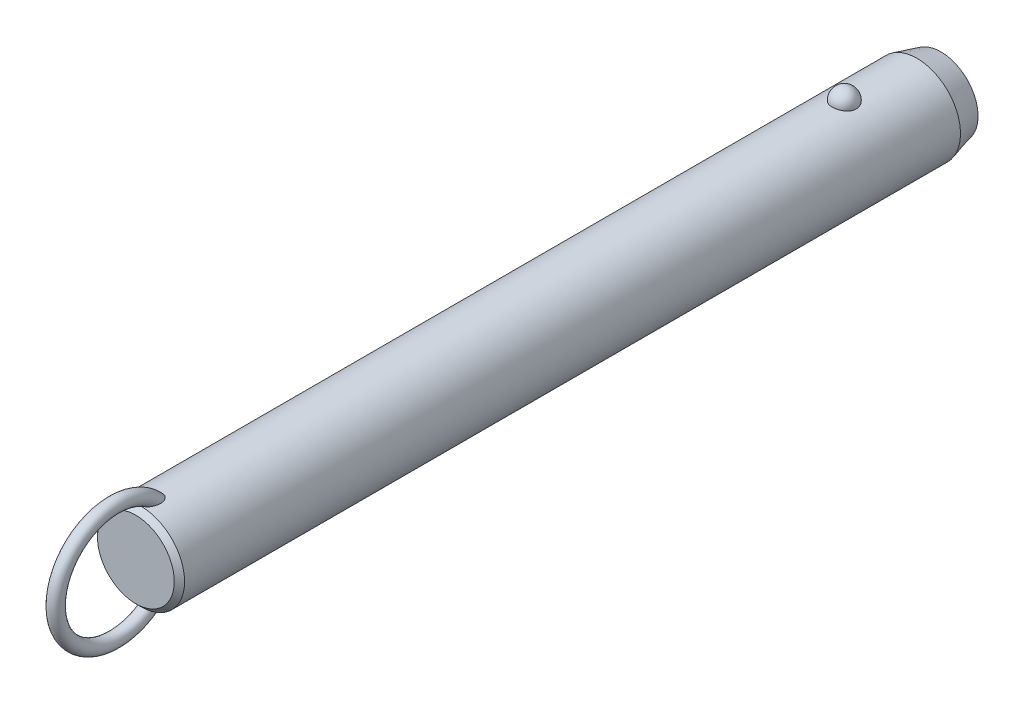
ISO-10303-21;
HEADER;
FILE_DESCRIPTION(('STEP AP214'),'2;1');
FILE_NAME('part.step','',(''),(''),'','','');
FILE_SCHEMA(('AUTOMOTIVE_DESIGN { 1 0 10303 214 1 1 1 1 }'));
ENDSEC;
DATA;
#1=APPLICATION_CONTEXT('core data for automotive mechanical design processes');
#2=APPLICATION_PROTOCOL_DEFINITION('international standard','automotive_design',2000,#1);
#3=PRODUCT_CONTEXT('',#1,'mechanical');
#4=PRODUCT('Part','Part','',(#3));
#5=PRODUCT_RELATED_PRODUCT_CATEGORY('part','',(#4));
#6=PRODUCT_DEFINITION_FORMATION('','',#4);
#7=PRODUCT_DEFINITION_CONTEXT('part definition',#1,'design');
#8=PRODUCT_DEFINITION('design','',#6,#7);
#9=PRODUCT_DEFINITION_SHAPE('','',#8);
#10=(LENGTH_UNIT() NAMED_UNIT(*) SI_UNIT(.MILLI.,.METRE.));
#11=(NAMED_UNIT(*) PLANE_ANGLE_UNIT() SI_UNIT($,.RADIAN.));
#12=(NAMED_UNIT(*) SI_UNIT($,.STERADIAN.) SOLID_ANGLE_UNIT());
#13=UNCERTAINTY_MEASURE_WITH_UNIT(LENGTH_MEASURE(1.E-05),#10,'distance_accuracy_value','');
#14=(GEOMETRIC_REPRESENTATION_CONTEXT(3) GLOBAL_UNCERTAINTY_ASSIGNED_CONTEXT((#13)) GLOBAL_UNIT_ASSIGNED_CONTEXT((#10,
#11,#12)) REPRESENTATION_CONTEXT('',''));
#15=CARTESIAN_POINT('',(0.,0.,0.));
#16=DIRECTION('',(0.,0.,1.));
#17=DIRECTION('',(1.,0.,0.));
#18=AXIS2_PLACEMENT_3D('',#15,#16,#17);
#19=CARTESIAN_POINT('',(0.,0.,190.5));
#20=DIRECTION('',(0.,0.,-1.));
#21=DIRECTION('',(-1.,0.,0.));
#22=AXIS2_PLACEMENT_3D('',#19,#20,#21);
#23=CYLINDRICAL_SURFACE('',#22,12.7);
#24=CARTESIAN_POINT('',(3.46661256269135,12.2177165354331,-3.50000000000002));
#25=CARTESIAN_POINT('',(3.4666090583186,12.2177194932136,-3.30432790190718));
#26=CARTESIAN_POINT('',(3.45063567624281,12.2222841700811,-3.10861112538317));
#27=CARTESIAN_POINT('',(3.38712451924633,12.2400345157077,-2.72271899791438));
#28=CARTESIAN_POINT('',(3.33957415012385,12.2532236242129,-2.53254588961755));
#29=CARTESIAN_POINT('',(3.2141234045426,12.286724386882,-2.16324948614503));
#30=CARTESIAN_POINT('',(3.13623639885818,12.3070329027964,-1.98412136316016));
#31=CARTESIAN_POINT('',(2.95205930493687,12.3525018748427,-1.6418059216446));
#32=CARTESIAN_POINT('',(2.84577003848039,12.3776621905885,-1.47861814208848));
#33=CARTESIAN_POINT('',(2.60688050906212,12.4301712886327,-1.17190583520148));
#34=CARTESIAN_POINT('',(2.47415697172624,12.4575299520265,-1.0284789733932));
#35=CARTESIAN_POINT('',(2.18615174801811,12.5112810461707,-0.766177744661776));
#36=CARTESIAN_POINT('',(2.03087002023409,12.5376734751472,-0.647303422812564));
#37=CARTESIAN_POINT('',(1.70237334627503,12.5864761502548,-0.437732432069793));
#38=CARTESIAN_POINT('',(1.52920948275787,12.6088972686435,-0.346958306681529));
#39=CARTESIAN_POINT('',(1.16944170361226,12.6473352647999,-0.195750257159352));
#40=CARTESIAN_POINT('',(0.982839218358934,12.663352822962,-0.135313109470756));
#41=CARTESIAN_POINT('',(0.604961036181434,12.6869706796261,-0.0473241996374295));
#42=CARTESIAN_POINT('',(0.41382314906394,12.6947125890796,-0.0192185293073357));
#43=CARTESIAN_POINT('',(0.0293827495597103,12.7014203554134,0.00517254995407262));
#44=CARTESIAN_POINT('',(-0.163919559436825,12.7003870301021,0.00146092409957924));
#45=CARTESIAN_POINT('',(-0.544374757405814,12.689735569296,-0.0373939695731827));
#46=CARTESIAN_POINT('',(-0.731575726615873,12.6802364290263,-0.0721015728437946));
#47=CARTESIAN_POINT('',(-1.09733277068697,12.6538333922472,-0.171364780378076));
#48=CARTESIAN_POINT('',(-1.27588869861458,12.6369293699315,-0.235920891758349));
#49=CARTESIAN_POINT('',(-1.6204698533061,12.5973946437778,-0.393548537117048));
#50=CARTESIAN_POINT('',(-1.78641865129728,12.5747321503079,-0.486778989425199));
#51=CARTESIAN_POINT('',(-2.10030671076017,12.5261316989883,-0.699110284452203));
#52=CARTESIAN_POINT('',(-2.24824419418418,12.5001934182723,-0.818213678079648));
#53=CARTESIAN_POINT('',(-2.52491489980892,12.4472906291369,-1.0815712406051));
#54=CARTESIAN_POINT('',(-2.65324222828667,12.4203160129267,-1.22624992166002));
#55=CARTESIAN_POINT('',(-2.88410007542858,12.3687509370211,-1.53528325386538));
#56=CARTESIAN_POINT('',(-2.98662883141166,12.3441606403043,-1.69963924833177));
#57=CARTESIAN_POINT('',(-3.16432417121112,12.2998199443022,-2.04548497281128));
#58=CARTESIAN_POINT('',(-3.23917525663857,12.2801261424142,-2.22714424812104));
#59=CARTESIAN_POINT('',(-3.35800573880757,12.248167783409,-2.60091389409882));
#60=CARTESIAN_POINT('',(-3.4019860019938,12.2359030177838,-2.79302397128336));
#61=CARTESIAN_POINT('',(-3.45784812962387,12.2202347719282,-3.18140279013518));
#62=CARTESIAN_POINT('',(-3.46986123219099,12.2167950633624,-3.37765118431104));
#63=CARTESIAN_POINT('',(-3.46186273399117,12.2190638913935,-3.76943689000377));
#64=CARTESIAN_POINT('',(-3.44185196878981,12.2247721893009,-3.96497421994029));
#65=CARTESIAN_POINT('',(-3.37048652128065,12.2446381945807,-4.34881728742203));
#66=CARTESIAN_POINT('',(-3.31928253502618,12.2587552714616,-4.53715319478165));
#67=CARTESIAN_POINT('',(-3.18693461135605,12.2938237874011,-4.9023172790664));
#68=CARTESIAN_POINT('',(-3.1057895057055,12.3147754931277,-5.07914500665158));
#69=CARTESIAN_POINT('',(-2.91506431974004,12.3613125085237,-5.41732059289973));
#70=CARTESIAN_POINT('',(-2.80533587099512,12.3869217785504,-5.57858147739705));
#71=CARTESIAN_POINT('',(-2.560414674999,12.4398525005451,-5.88013283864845));
#72=CARTESIAN_POINT('',(-2.42522099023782,12.4671740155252,-6.02042254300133));
#73=CARTESIAN_POINT('',(-2.1323357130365,12.5205965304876,-6.27662798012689));
#74=CARTESIAN_POINT('',(-1.97456596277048,12.5466928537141,-6.39245542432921));
#75=CARTESIAN_POINT('',(-1.64115839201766,12.5946384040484,-6.59583547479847));
#76=CARTESIAN_POINT('',(-1.46552179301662,12.6164879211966,-6.68339001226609));
#77=CARTESIAN_POINT('',(-1.10356050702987,12.6532533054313,-6.82682153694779));
#78=CARTESIAN_POINT('',(-0.9173913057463,12.6682500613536,-6.88306988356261));
#79=CARTESIAN_POINT('',(-0.537836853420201,12.6900288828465,-6.96386887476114));
#80=CARTESIAN_POINT('',(-0.344452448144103,12.6968119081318,-6.98842322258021));
#81=CARTESIAN_POINT('',(0.0402577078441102,12.7013667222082,-7.00496469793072));
#82=CARTESIAN_POINT('',(0.231556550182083,12.6993008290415,-6.99753844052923));
#83=CARTESIAN_POINT('',(0.610105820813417,12.6867505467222,-6.95166366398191));
#84=CARTESIAN_POINT('',(0.797356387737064,12.6762664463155,-6.91321620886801));
#85=CARTESIAN_POINT('',(1.16186657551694,12.6480587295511,-6.80658431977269));
#86=CARTESIAN_POINT('',(1.33915951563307,12.6303611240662,-6.73850666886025));
#87=CARTESIAN_POINT('',(1.67968518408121,12.5896027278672,-6.57450875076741));
#88=CARTESIAN_POINT('',(1.84291705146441,12.5665416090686,-6.47858678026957));
#89=CARTESIAN_POINT('',(2.15340192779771,12.5171072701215,-6.25982455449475));
#90=CARTESIAN_POINT('',(2.30037831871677,12.4906895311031,-6.13660186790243));
#91=CARTESIAN_POINT('',(2.5717412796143,12.4376567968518,-5.86739587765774));
#92=CARTESIAN_POINT('',(2.69612388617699,12.4110417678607,-5.72140858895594));
#93=CARTESIAN_POINT('',(2.92107785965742,12.360051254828,-5.40794137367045));
#94=CARTESIAN_POINT('',(3.02121329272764,12.3357209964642,-5.24014110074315));
#95=CARTESIAN_POINT('',(3.19236291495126,12.2925446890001,-4.88969865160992));
#96=CARTESIAN_POINT('',(3.26338839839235,12.2736965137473,-4.70706226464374));
#97=CARTESIAN_POINT('',(3.36788038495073,12.245404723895,-4.35469510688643));
#98=CARTESIAN_POINT('',(3.40484026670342,12.2351018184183,-4.18605935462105));
#99=CARTESIAN_POINT('',(3.45420764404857,12.2212564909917,-3.84496058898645));
#100=CARTESIAN_POINT('',(3.46661565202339,12.2177139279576,-3.67249765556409));
#101=CARTESIAN_POINT('',(3.46661256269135,12.2177165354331,-3.50000000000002));
#102=B_SPLINE_CURVE_WITH_KNOTS('',3,(#24,#25,#26,#27,#28,#29,#30,#31,#32,#33,#34,#35,#36,#37,
#38,#39,#40,#41,#42,#43,#44,#45,#46,#47,#48,#49,#50,#51,#52,#53,#54,#55,#56,#57,#58,#59,#60,#61,
#62,#63,#64,#65,#66,#67,#68,#69,#70,#71,#72,#73,#74,#75,#76,#77,#78,#79,#80,#81,#82,#83,#84,#85,
#86,#87,#88,#89,#90,#91,#92,#93,#94,#95,#96,#97,#98,#99,#100,#101),.UNSPECIFIED.,.T.,.F.,(4,2,2,
2,2,2,2,2,2,2,2,2,2,2,2,2,2,2,2,2,2,2,2,2,2,2,2,2,2,2,2,2,2,2,2,2,2,2,4),(0.,0.586396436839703,
1.17302689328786,1.7593990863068,2.34575431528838,2.93491084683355,3.52406845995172,
4.11158733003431,4.69904375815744,5.2762784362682,5.85345931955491,6.42265312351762,
6.99185659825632,7.56427334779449,8.136746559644,8.71981013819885,9.3029135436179,
9.89247258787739,10.4820150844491,11.0691335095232,11.6562366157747,12.2405256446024,
12.8248374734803,13.412244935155,13.9996740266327,14.5891883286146,15.1786623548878,
15.7609861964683,16.3432419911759,16.9148635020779,17.4864654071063,18.0560241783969,
18.6256177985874,19.2037609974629,19.7820055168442,20.3699810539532,20.957728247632,
21.4746855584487,21.9916320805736),.UNSPECIFIED.);
#103=CARTESIAN_POINT('',(3.46661256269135,12.2177165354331,-3.50000000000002));
#104=VERTEX_POINT('',#103);
#105=EDGE_CURVE('E41',#104,#104,#102,.T.);
#106=ORIENTED_EDGE('',*,*,#105,.T.);
#107=EDGE_LOOP('',(#106));
#108=FACE_BOUND('',#107,.T.);
#109=CARTESIAN_POINT('',(0.,0.,201.7));
#110=DIRECTION('',(0.,0.,1.));
#111=DIRECTION('',(1.,0.,0.));
#112=AXIS2_PLACEMENT_3D('',#109,#110,#111);
#113=CIRCLE('',#112,12.7);
#114=CARTESIAN_POINT('',(12.7,0.,201.7));
#115=VERTEX_POINT('',#114);
#116=EDGE_CURVE('E10',#115,#115,#113,.F.);
#117=ORIENTED_EDGE('',*,*,#116,.T.);
#118=EDGE_LOOP('',(#117));
#119=FACE_BOUND('',#118,.T.);
#120=CARTESIAN_POINT('',(-0.548122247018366,-12.6881662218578,195.443218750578));
#121=CARTESIAN_POINT('',(-0.648865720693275,-12.6838128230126,195.477926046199));
#122=CARTESIAN_POINT('',(-0.746398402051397,-12.6783867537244,195.522042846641));
#123=CARTESIAN_POINT('',(-0.932125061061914,-12.666091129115,195.626764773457));
#124=CARTESIAN_POINT('',(-1.02030388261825,-12.6592192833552,195.687396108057));
#125=CARTESIAN_POINT('',(-1.18487740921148,-12.6448747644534,195.821847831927));
#126=CARTESIAN_POINT('',(-1.26134296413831,-12.637406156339,195.895582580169));
#127=CARTESIAN_POINT('',(-1.4023120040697,-12.6225412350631,196.053604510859));
#128=CARTESIAN_POINT('',(-1.466814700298,-12.6151449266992,196.13789238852));
#129=CARTESIAN_POINT('',(-1.60714786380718,-12.5981718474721,196.349657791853));
#130=CARTESIAN_POINT('',(-1.67725126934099,-12.588900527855,196.480962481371));
#131=CARTESIAN_POINT('',(-1.79536591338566,-12.5725964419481,196.753247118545));
#132=CARTESIAN_POINT('',(-1.84333535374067,-12.5655679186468,196.894244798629));
#133=CARTESIAN_POINT('',(-1.93422576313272,-12.5519624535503,197.237645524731));
#134=CARTESIAN_POINT('',(-1.96788773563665,-12.5466298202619,197.442557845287));
#135=CARTESIAN_POINT('',(-1.9941399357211,-12.542463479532,197.751760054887));
#136=CARTESIAN_POINT('',(-1.99883864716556,-12.5417153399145,197.855298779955));
#137=CARTESIAN_POINT('',(-2.00078003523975,-12.5414074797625,198.06245124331));
#138=CARTESIAN_POINT('',(-1.99802449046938,-12.5418474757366,198.166064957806));
#139=CARTESIAN_POINT('',(-1.98336733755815,-12.5441750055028,198.41032076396));
#140=CARTESIAN_POINT('',(-1.96851430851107,-12.5465291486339,198.550780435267));
#141=CARTESIAN_POINT('',(-1.92707089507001,-12.5529612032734,198.829960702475));
#142=CARTESIAN_POINT('',(-1.90047458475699,-12.5570399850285,198.968680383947));
#143=CARTESIAN_POINT('',(-1.8361912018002,-12.5666008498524,199.24341135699));
#144=CARTESIAN_POINT('',(-1.79850828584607,-12.57208240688,199.379423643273));
#145=CARTESIAN_POINT('',(-1.71223796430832,-12.5841228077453,199.647842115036));
#146=CARTESIAN_POINT('',(-1.66365679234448,-12.5906810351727,199.780250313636));
#147=CARTESIAN_POINT('',(-1.5780450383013,-12.6016176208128,199.98548877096));
#148=CARTESIAN_POINT('',(-1.54477252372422,-12.6057501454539,200.059914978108));
#149=CARTESIAN_POINT('',(-1.47424480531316,-12.6141930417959,200.206839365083));
#150=CARTESIAN_POINT('',(-1.436990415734,-12.6185033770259,200.279337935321));
#151=CARTESIAN_POINT('',(-1.35825795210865,-12.6272207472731,200.421892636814));
#152=CARTESIAN_POINT('',(-1.31678520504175,-12.6316276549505,200.491951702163));
#153=CARTESIAN_POINT('',(-1.22917793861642,-12.6404532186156,200.629070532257));
#154=CARTESIAN_POINT('',(-1.18304514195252,-12.6448718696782,200.696131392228));
#155=CARTESIAN_POINT('',(-1.07246411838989,-12.6547893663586,200.843874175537));
#156=CARTESIAN_POINT('',(-1.00642239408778,-12.6602600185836,200.923384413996));
#157=CARTESIAN_POINT('',(-0.86444142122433,-12.6707460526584,201.073169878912));
#158=CARTESIAN_POINT('',(-0.788516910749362,-12.6757620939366,201.143458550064));
#159=CARTESIAN_POINT('',(-0.652215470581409,-12.6833591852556,201.248680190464));
#160=CARTESIAN_POINT('',(-0.59498203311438,-12.6861973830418,201.287624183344));
#161=CARTESIAN_POINT('',(-0.475269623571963,-12.6912445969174,201.356489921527));
#162=CARTESIAN_POINT('',(-0.412800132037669,-12.6934547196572,201.386427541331));
#163=CARTESIAN_POINT('',(-0.295749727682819,-12.6966636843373,201.42975652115));
#164=CARTESIAN_POINT('',(-0.241949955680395,-12.6978134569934,201.445218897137));
#165=CARTESIAN_POINT('',(-0.132508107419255,-12.6994261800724,201.466884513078));
#166=CARTESIAN_POINT('',(-0.0768679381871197,-12.6998898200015,201.473097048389));
#167=CARTESIAN_POINT('',(0.0347696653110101,-12.7000752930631,201.475583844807));
#168=CARTESIAN_POINT('',(0.0907676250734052,-12.6997954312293,201.471835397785));
#169=CARTESIAN_POINT('',(0.201283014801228,-12.6985255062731,201.454788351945));
#170=CARTESIAN_POINT('',(0.255799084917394,-12.6975348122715,201.441481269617));
#171=CARTESIAN_POINT('',(0.376042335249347,-12.6946091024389,201.40203792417));
#172=CARTESIAN_POINT('',(0.440950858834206,-12.6924943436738,201.373449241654));
#173=CARTESIAN_POINT('',(0.56535027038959,-12.6875639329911,201.306323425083));
#174=CARTESIAN_POINT('',(0.624828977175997,-12.6847467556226,201.267764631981));
#175=CARTESIAN_POINT('',(0.774116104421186,-12.6767252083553,201.156949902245));
#176=CARTESIAN_POINT('',(0.859449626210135,-12.6711344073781,201.078760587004));
#177=CARTESIAN_POINT('',(1.01789440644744,-12.6593922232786,200.910943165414));
#178=CARTESIAN_POINT('',(1.09096902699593,-12.653239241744,200.821282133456));
#179=CARTESIAN_POINT('',(1.22268793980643,-12.6411674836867,200.640265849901));
#180=CARTESIAN_POINT('',(1.28193986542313,-12.6352572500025,200.549345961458));
#181=CARTESIAN_POINT('',(1.39259777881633,-12.6235401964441,200.362792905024));
#182=CARTESIAN_POINT('',(1.44399707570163,-12.6177334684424,200.267155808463));
#183=CARTESIAN_POINT('',(1.53972870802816,-12.6064093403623,200.072273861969));
#184=CARTESIAN_POINT('',(1.58405262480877,-12.6008922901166,199.973024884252));
#185=CARTESIAN_POINT('',(1.66600705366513,-12.5903187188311,199.771772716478));
#186=CARTESIAN_POINT('',(1.70363651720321,-12.5852622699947,199.669769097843));
#187=CARTESIAN_POINT('',(1.77545379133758,-12.5753406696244,199.454358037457));
#188=CARTESIAN_POINT('',(1.80903453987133,-12.5705328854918,199.340745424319));
#189=CARTESIAN_POINT('',(1.86844163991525,-12.5618400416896,199.111457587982));
#190=CARTESIAN_POINT('',(1.89426665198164,-12.5579551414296,198.995782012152));
#191=CARTESIAN_POINT('',(1.9378546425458,-12.5513030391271,198.763007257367));
#192=CARTESIAN_POINT('',(1.95562640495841,-12.5485346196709,198.645909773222));
#193=CARTESIAN_POINT('',(1.98264463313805,-12.5442934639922,198.410747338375));
#194=CARTESIAN_POINT('',(1.99189298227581,-12.5428204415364,198.29268260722));
#195=CARTESIAN_POINT('',(2.00416068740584,-12.540871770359,197.980622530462));
#196=CARTESIAN_POINT('',(1.99944433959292,-12.541631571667,197.786229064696));
#197=CARTESIAN_POINT('',(1.96113755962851,-12.5476846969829,197.400309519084));
#198=CARTESIAN_POINT('',(1.92758341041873,-12.5529723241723,197.208780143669));
#199=CARTESIAN_POINT('',(1.83934342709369,-12.5661532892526,196.882272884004));
#200=CARTESIAN_POINT('',(1.79215440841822,-12.5730485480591,196.74524997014));
#201=CARTESIAN_POINT('',(1.67676242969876,-12.588958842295,196.480445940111));
#202=CARTESIAN_POINT('',(1.60859050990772,-12.597970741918,196.352651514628));
#203=CARTESIAN_POINT('',(1.46583832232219,-12.6152829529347,196.135800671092));
#204=CARTESIAN_POINT('',(1.39525727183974,-12.6233659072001,196.04410500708));
#205=CARTESIAN_POINT('',(1.23992594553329,-12.6395676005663,195.873485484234));
#206=CARTESIAN_POINT('',(1.15517932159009,-12.6476863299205,195.794558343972));
#207=CARTESIAN_POINT('',(0.971995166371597,-12.6630846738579,195.652643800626));
#208=CARTESIAN_POINT('',(0.873456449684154,-12.6703572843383,195.589784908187));
#209=CARTESIAN_POINT('',(0.665847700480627,-12.6829569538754,195.484487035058));
#210=CARTESIAN_POINT('',(0.556784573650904,-12.688285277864,195.442034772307));
#211=CARTESIAN_POINT('',(0.347338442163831,-12.6956226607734,195.384443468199));
#212=CARTESIAN_POINT('',(0.247759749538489,-12.6979816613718,195.366399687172));
#213=CARTESIAN_POINT('',(0.0470218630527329,-12.7003077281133,195.348600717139));
#214=CARTESIAN_POINT('',(-0.0541350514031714,-12.7002779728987,195.348821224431));
#215=CARTESIAN_POINT('',(-0.221414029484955,-12.6982482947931,195.364363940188));
#216=CARTESIAN_POINT('',(-0.288055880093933,-12.6969033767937,195.374666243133));
#217=CARTESIAN_POINT('',(-0.419599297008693,-12.6932369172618,195.40313489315));
#218=CARTESIAN_POINT('',(-0.484501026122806,-12.6909154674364,195.421300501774));
#219=CARTESIAN_POINT('',(-0.548122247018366,-12.6881662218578,195.443218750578));
#220=B_SPLINE_CURVE_WITH_KNOTS('',3,(#120,#121,#122,#123,#124,#125,#126,#127,#128,#129,#130,
#131,#132,#133,#134,#135,#136,#137,#138,#139,#140,#141,#142,#143,#144,#145,#146,#147,#148,#149,
#150,#151,#152,#153,#154,#155,#156,#157,#158,#159,#160,#161,#162,#163,#164,#165,#166,#167,#168,
#169,#170,#171,#172,#173,#174,#175,#176,#177,#178,#179,#180,#181,#182,#183,#184,#185,#186,#187,
#188,#189,#190,#191,#192,#193,#194,#195,#196,#197,#198,#199,#200,#201,#202,#203,#204,#205,#206,
#207,#208,#209,#210,#211,#212,#213,#214,#215,#216,#217,#218,#219),.UNSPECIFIED.,.T.,.F.,(4,2,2,
2,2,2,2,2,2,2,2,2,2,2,2,2,2,2,2,2,2,2,2,2,2,2,2,2,2,2,2,2,2,2,2,2,2,2,2,2,2,2,2,2,2,2,2,2,2,4),
(0.,0.31964225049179,0.639794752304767,0.957927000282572,1.27608021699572,1.72100165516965,
2.16675988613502,2.78630021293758,3.09705782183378,3.40774128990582,3.83096358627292,
4.25439969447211,4.67767724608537,5.10071330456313,5.34550297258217,5.59024267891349,
5.83467707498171,6.07902143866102,6.38891080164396,6.69834321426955,6.9056091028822,
7.11250749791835,7.27977315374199,7.44687060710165,7.61434932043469,7.78197685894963,
7.99365544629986,8.20579780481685,8.55147335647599,8.89816429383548,9.22375138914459,
9.54961437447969,9.8758622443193,10.202161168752,10.557587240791,10.9130746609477,
11.2681734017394,11.6231936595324,12.2046601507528,12.7853961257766,13.219164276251,
13.6522938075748,13.9989174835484,14.3454519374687,14.6946768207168,15.0436740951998,
15.3457513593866,15.6474266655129,15.8493051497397,16.0511646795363),.UNSPECIFIED.);
#221=CARTESIAN_POINT('',(-0.548122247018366,-12.6881662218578,195.443218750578));
#222=VERTEX_POINT('',#221);
#223=EDGE_CURVE('E60',#222,#222,#220,.T.);
#224=ORIENTED_EDGE('',*,*,#223,.T.);
#225=EDGE_LOOP('',(#224));
#226=FACE_BOUND('',#225,.T.);
#227=CARTESIAN_POINT('',(-0.548122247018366,12.6881662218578,195.443218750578));
#228=CARTESIAN_POINT('',(-0.459436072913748,12.6919968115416,195.412673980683));
#229=CARTESIAN_POINT('',(-0.368189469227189,12.6949996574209,195.389391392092));
#230=CARTESIAN_POINT('',(-0.183024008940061,12.6990186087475,195.358406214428));
#231=CARTESIAN_POINT('',(-0.0891049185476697,12.7000345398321,195.350704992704));
#232=CARTESIAN_POINT('',(0.0987147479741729,12.6999636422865,195.351245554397));
#233=CARTESIAN_POINT('',(0.192615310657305,12.6988761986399,195.359492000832));
#234=CARTESIAN_POINT('',(0.377658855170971,12.6947211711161,195.391551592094));
#235=CARTESIAN_POINT('',(0.468801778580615,12.6916535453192,195.415365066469));
#236=CARTESIAN_POINT('',(0.645809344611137,12.6838788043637,195.47745651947));
#237=CARTESIAN_POINT('',(0.731679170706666,12.6791733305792,195.515720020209));
#238=CARTESIAN_POINT('',(0.896315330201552,12.6686004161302,195.605120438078));
#239=CARTESIAN_POINT('',(0.975080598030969,12.6627328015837,195.656259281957));
#240=CARTESIAN_POINT('',(1.12963655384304,12.6499161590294,195.77367820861));
#241=CARTESIAN_POINT('',(1.20478673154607,12.6429194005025,195.840792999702));
#242=CARTESIAN_POINT('',(1.34448241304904,12.6288282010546,195.98522507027));
#243=CARTESIAN_POINT('',(1.40902173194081,12.621733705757,196.062548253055));
#244=CARTESIAN_POINT('',(1.55208211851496,12.6050877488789,196.259247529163));
#245=CARTESIAN_POINT('',(1.62510490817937,12.5957546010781,196.382654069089));
#246=CARTESIAN_POINT('',(1.7501904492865,12.5789823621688,196.639769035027));
#247=CARTESIAN_POINT('',(1.80221377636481,12.5715468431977,196.773496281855));
#248=CARTESIAN_POINT('',(1.90309965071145,12.5567434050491,197.098351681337));
#249=CARTESIAN_POINT('',(1.94342317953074,12.5504515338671,197.292161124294));
#250=CARTESIAN_POINT('',(1.99332997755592,12.5426147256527,197.68378810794));
#251=CARTESIAN_POINT('',(2.00285305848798,12.5410790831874,197.881612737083));
#252=CARTESIAN_POINT('',(1.99678999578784,12.5420407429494,198.216642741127));
#253=CARTESIAN_POINT('',(1.98794117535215,12.5434564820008,198.354042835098));
#254=CARTESIAN_POINT('',(1.95865119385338,12.5480641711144,198.627639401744));
#255=CARTESIAN_POINT('',(1.93820436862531,12.5512569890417,198.763835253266));
#256=CARTESIAN_POINT('',(1.88647896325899,12.5591352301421,199.034249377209));
#257=CARTESIAN_POINT('',(1.85518800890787,12.5638223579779,199.168465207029));
#258=CARTESIAN_POINT('',(1.78217886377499,12.5743868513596,199.433936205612));
#259=CARTESIAN_POINT('',(1.74046509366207,12.5802637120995,199.565192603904));
#260=CARTESIAN_POINT('',(1.66024095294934,12.5910571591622,199.786085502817));
#261=CARTESIAN_POINT('',(1.62434772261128,12.5957535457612,199.876690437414));
#262=CARTESIAN_POINT('',(1.54709009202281,12.6054762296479,200.055512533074));
#263=CARTESIAN_POINT('',(1.50572681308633,12.6105024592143,200.143730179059));
#264=CARTESIAN_POINT('',(1.41728020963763,12.620748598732,200.316932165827));
#265=CARTESIAN_POINT('',(1.37021377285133,12.625967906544,200.401925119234));
#266=CARTESIAN_POINT('',(1.26969620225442,12.6364721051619,200.568007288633));
#267=CARTESIAN_POINT('',(1.21624929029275,12.6417569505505,200.649099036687));
#268=CARTESIAN_POINT('',(1.10304413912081,12.6521331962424,200.804702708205));
#269=CARTESIAN_POINT('',(1.04340936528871,12.657226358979,200.879303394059));
#270=CARTESIAN_POINT('',(0.915919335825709,12.667090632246,201.021324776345));
#271=CARTESIAN_POINT('',(0.848064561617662,12.6718617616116,201.08874589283));
#272=CARTESIAN_POINT('',(0.717035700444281,12.67987711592,201.200624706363));
#273=CARTESIAN_POINT('',(0.655526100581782,12.6832377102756,201.246997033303));
#274=CARTESIAN_POINT('',(0.525985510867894,12.6892676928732,201.329619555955));
#275=CARTESIAN_POINT('',(0.457969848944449,12.6919386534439,201.365892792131));
#276=CARTESIAN_POINT('',(0.334859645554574,12.695691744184,201.416657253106));
#277=CARTESIAN_POINT('',(0.281116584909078,12.6970073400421,201.434373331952));
#278=CARTESIAN_POINT('',(0.171425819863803,12.6989609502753,201.460642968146));
#279=CARTESIAN_POINT('',(0.115480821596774,12.699599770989,201.469207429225));
#280=CARTESIAN_POINT('',(0.00272618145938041,12.7001251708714,201.476253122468));
#281=CARTESIAN_POINT('',(-0.0540859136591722,12.7000089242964,201.474696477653));
#282=CARTESIAN_POINT('',(-0.16654462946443,12.6990328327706,201.461600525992));
#283=CARTESIAN_POINT('',(-0.222190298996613,12.6981724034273,201.450053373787));
#284=CARTESIAN_POINT('',(-0.342018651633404,12.695562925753,201.414912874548));
#285=CARTESIAN_POINT('',(-0.405606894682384,12.6936676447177,201.38933225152));
#286=CARTESIAN_POINT('',(-0.527815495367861,12.6891754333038,201.328311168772));
#287=CARTESIAN_POINT('',(-0.586425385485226,12.6865770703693,201.292850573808));
#288=CARTESIAN_POINT('',(-0.731842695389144,12.6792129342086,201.191496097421));
#289=CARTESIAN_POINT('',(-0.81470941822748,12.6740767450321,201.1200395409));
#290=CARTESIAN_POINT('',(-0.969101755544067,12.6632083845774,200.96589007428));
#291=CARTESIAN_POINT('',(-1.04059564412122,12.6574746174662,200.883166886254));
#292=CARTESIAN_POINT('',(-1.16981116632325,12.6461638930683,200.715809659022));
#293=CARTESIAN_POINT('',(-1.22811369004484,12.6405994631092,200.631616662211));
#294=CARTESIAN_POINT('',(-1.33743405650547,12.6295007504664,200.458579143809));
#295=CARTESIAN_POINT('',(-1.38844577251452,12.6239664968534,200.369730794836));
#296=CARTESIAN_POINT('',(-1.48400702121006,12.6130898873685,200.188389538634));
#297=CARTESIAN_POINT('',(-1.52854232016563,12.6077479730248,200.095889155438));
#298=CARTESIAN_POINT('',(-1.61150113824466,12.5974127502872,199.908160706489));
#299=CARTESIAN_POINT('',(-1.64992317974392,12.5924195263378,199.812931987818));
#300=CARTESIAN_POINT('',(-1.73468589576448,12.581070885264,199.58289362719));
#301=CARTESIAN_POINT('',(-1.77831261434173,12.5749388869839,199.447066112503));
#302=CARTESIAN_POINT('',(-1.85439734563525,12.5639437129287,199.172212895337));
#303=CARTESIAN_POINT('',(-1.88684994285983,12.5590811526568,199.033185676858));
#304=CARTESIAN_POINT('',(-1.94008483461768,12.550968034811,198.75309235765));
#305=CARTESIAN_POINT('',(-1.96088706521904,12.5477147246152,198.612030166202));
#306=CARTESIAN_POINT('',(-1.99000539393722,12.5431291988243,198.328668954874));
#307=CARTESIAN_POINT('',(-1.99832911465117,12.5417958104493,198.186370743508));
#308=CARTESIAN_POINT('',(-2.00166624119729,12.5412674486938,197.857627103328));
#309=CARTESIAN_POINT('',(-1.99178843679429,12.5428579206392,197.671088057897));
#310=CARTESIAN_POINT('',(-1.94455183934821,12.5502731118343,197.30162404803));
#311=CARTESIAN_POINT('',(-1.90724032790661,12.5560905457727,197.118693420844));
#312=CARTESIAN_POINT('',(-1.81330718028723,12.5699462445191,196.804848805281));
#313=CARTESIAN_POINT('',(-1.76338820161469,12.5771273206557,196.671910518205));
#314=CARTESIAN_POINT('',(-1.64305018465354,12.593414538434,196.415681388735));
#315=CARTESIAN_POINT('',(-1.57265346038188,12.6025185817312,196.292380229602));
#316=CARTESIAN_POINT('',(-1.42634956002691,12.6198178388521,196.083564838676));
#317=CARTESIAN_POINT('',(-1.35423772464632,12.6278405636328,195.995384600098));
#318=CARTESIAN_POINT('',(-1.19645664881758,12.6437632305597,195.832107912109));
#319=CARTESIAN_POINT('',(-1.1108053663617,12.6516633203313,195.756994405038));
#320=CARTESIAN_POINT('',(-0.947219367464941,12.6648319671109,195.637811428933));
#321=CARTESIAN_POINT('',(-0.871624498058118,12.670300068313,195.590541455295));
#322=CARTESIAN_POINT('',(-0.714161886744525,12.6801492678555,195.5077413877));
#323=CARTESIAN_POINT('',(-0.632295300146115,12.684530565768,195.47220913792));
#324=CARTESIAN_POINT('',(-0.548122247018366,12.6881662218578,195.443218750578));
#325=B_SPLINE_CURVE_WITH_KNOTS('',3,(#227,#228,#229,#230,#231,#232,#233,#234,#235,#236,#237,
#238,#239,#240,#241,#242,#243,#244,#245,#246,#247,#248,#249,#250,#251,#252,#253,#254,#255,#256,
#257,#258,#259,#260,#261,#262,#263,#264,#265,#266,#267,#268,#269,#270,#271,#272,#273,#274,#275,
#276,#277,#278,#279,#280,#281,#282,#283,#284,#285,#286,#287,#288,#289,#290,#291,#292,#293,#294,
#295,#296,#297,#298,#299,#300,#301,#302,#303,#304,#305,#306,#307,#308,#309,#310,#311,#312,#313,
#314,#315,#316,#317,#318,#319,#320,#321,#322,#323,#324),.UNSPECIFIED.,.T.,.F.,(4,2,2,2,2,2,2,2,
2,2,2,2,2,2,2,2,2,2,2,2,2,2,2,2,2,2,2,2,2,2,2,2,2,2,2,2,2,2,2,2,2,2,2,2,2,2,2,2,4),(0.,
0.281328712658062,0.562682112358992,0.844117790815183,1.12555942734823,1.40671982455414,
1.68792232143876,1.98972294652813,2.29169886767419,2.72039860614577,3.14989948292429,
3.74084916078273,4.33295293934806,4.74554109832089,5.15833092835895,5.57159335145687,
5.98468079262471,6.27722775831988,6.56971484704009,6.86135609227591,7.15280542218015,
7.43927407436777,7.72572595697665,7.95635862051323,8.18646071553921,8.35559393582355,
8.52452541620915,8.69408946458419,8.86378678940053,9.06834348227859,9.27332014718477,
9.60010414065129,9.92778432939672,10.2350252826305,10.5425229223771,10.8506864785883,
11.15892440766,11.5867893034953,12.0148612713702,12.4421984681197,12.8692745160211,
13.4279365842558,13.9856380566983,14.4107062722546,14.835313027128,15.1765567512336,
15.517351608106,15.7844129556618,16.051425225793),.UNSPECIFIED.);
#326=CARTESIAN_POINT('',(-0.548122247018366,12.6881662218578,195.443218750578));
#327=VERTEX_POINT('',#326);
#328=EDGE_CURVE('E67',#327,#327,#325,.T.);
#329=ORIENTED_EDGE('',*,*,#328,.T.);
#330=EDGE_LOOP('',(#329));
#331=FACE_BOUND('',#330,.T.);
#332=CARTESIAN_POINT('',(0.,0.,-24.6999999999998));
#333=DIRECTION('',(0.,0.,-1.));
#334=DIRECTION('',(-1.,0.,0.));
#335=AXIS2_PLACEMENT_3D('',#332,#333,#334);
#336=CIRCLE('',#335,12.7);
#337=CARTESIAN_POINT('',(-12.7,0.,-24.6999999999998));
#338=VERTEX_POINT('',#337);
#339=EDGE_CURVE('E57',#338,#338,#336,.F.);
#340=ORIENTED_EDGE('',*,*,#339,.T.);
#341=EDGE_LOOP('',(#340));
#342=FACE_BOUND('',#341,.T.);
#343=ADVANCED_FACE('F37',(#108,#119,#226,#331,#342),#23,.T.);
#344=CARTESIAN_POINT('',(0.,0.,-31.7));
#345=DIRECTION('',(0.,0.,-1.));
#346=DIRECTION('',(-1.,0.,0.));
#347=AXIS2_PLACEMENT_3D('',#344,#345,#346);
#348=PLANE('',#347);
#349=CARTESIAN_POINT('',(0.,0.,-31.7));
#350=DIRECTION('',(0.,0.,-1.));
#351=DIRECTION('',(-1.,0.,0.));
#352=AXIS2_PLACEMENT_3D('',#349,#350,#351);
#353=CIRCLE('',#352,10.8243556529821);
#354=CARTESIAN_POINT('',(-10.8243556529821,0.,-31.7));
#355=VERTEX_POINT('',#354);
#356=EDGE_CURVE('E66',#355,#355,#353,.T.);
#357=ORIENTED_EDGE('',*,*,#356,.T.);
#358=EDGE_LOOP('',(#357));
#359=FACE_BOUND('',#358,.T.);
#360=ADVANCED_FACE('F85',(#359),#348,.T.);
#361=CARTESIAN_POINT('',(0.,0.,-31.7));
#362=DIRECTION('',(0.,0.,1.));
#363=DIRECTION('',(1.,0.,0.));
#364=AXIS2_PLACEMENT_3D('',#361,#362,#363);
#365=CONICAL_SURFACE('',#364,10.8243556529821,0.261799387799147);
#366=ORIENTED_EDGE('',*,*,#339,.F.);
#367=EDGE_LOOP('',(#366));
#368=FACE_BOUND('',#367,.T.);
#369=ORIENTED_EDGE('',*,*,#356,.F.);
#370=EDGE_LOOP('',(#369));
#371=FACE_BOUND('',#370,.T.);
#372=ADVANCED_FACE('F83',(#368,#371),#365,.T.);
#373=CARTESIAN_POINT('',(0.,0.,203.2));
#374=DIRECTION('',(0.,0.,1.));
#375=DIRECTION('',(1.,0.,0.));
#376=AXIS2_PLACEMENT_3D('',#373,#374,#375);
#377=PLANE('',#376);
#378=CARTESIAN_POINT('',(0.,0.,203.2));
#379=DIRECTION('',(0.,0.,1.));
#380=DIRECTION('',(1.,0.,0.));
#381=AXIS2_PLACEMENT_3D('',#378,#379,#380);
#382=CIRCLE('',#381,11.2);
#383=CARTESIAN_POINT('',(11.2,0.,203.2));
#384=VERTEX_POINT('',#383);
#385=EDGE_CURVE('E50',#384,#384,#382,.T.);
#386=ORIENTED_EDGE('',*,*,#385,.T.);
#387=EDGE_LOOP('',(#386));
#388=FACE_BOUND('',#387,.T.);
#389=ADVANCED_FACE('F77',(#388),#377,.T.);
#390=CARTESIAN_POINT('',(0.,0.,209.55));
#391=DIRECTION('',(1.,0.,0.));
#392=DIRECTION('',(0.,0.,-1.));
#393=AXIS2_PLACEMENT_3D('',#390,#391,#392);
#394=TOROIDAL_SURFACE('',#393,17.05,2.);
#395=ORIENTED_EDGE('',*,*,#328,.F.);
#396=EDGE_LOOP('',(#395));
#397=FACE_BOUND('',#396,.T.);
#398=ORIENTED_EDGE('',*,*,#223,.F.);
#399=EDGE_LOOP('',(#398));
#400=FACE_BOUND('',#399,.T.);
#401=ADVANCED_FACE('F73',(#397,#400),#394,.T.);
#402=CARTESIAN_POINT('',(0.,0.,203.2));
#403=DIRECTION('',(0.,0.,-1.));
#404=DIRECTION('',(-1.,0.,0.));
#405=AXIS2_PLACEMENT_3D('',#402,#403,#404);
#406=CONICAL_SURFACE('',#405,11.2,0.785398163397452);
#407=ORIENTED_EDGE('',*,*,#116,.F.);
#408=EDGE_LOOP('',(#407));
#409=FACE_BOUND('',#408,.T.);
#410=ORIENTED_EDGE('',*,*,#385,.F.);
#411=EDGE_LOOP('',(#410));
#412=FACE_BOUND('',#411,.T.);
#413=ADVANCED_FACE('F39',(#409,#412),#406,.T.);
#414=CARTESIAN_POINT('',(0.,12.7,-3.50000000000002));
#415=DIRECTION('',(0.,1.,0.));
#416=DIRECTION('',(0.,0.,-1.));
#417=AXIS2_PLACEMENT_3D('',#414,#415,#416);
#418=SPHERICAL_SURFACE('',#417,3.5);
#419=ORIENTED_EDGE('',*,*,#105,.F.);
#420=EDGE_LOOP('',(#419));
#421=FACE_BOUND('',#420,.T.);
#422=ADVANCED_FACE('F79',(#421),#418,.T.);
#423=CLOSED_SHELL('',(#343,#360,#372,#389,#401,#413,#422));
#424=MANIFOLD_SOLID_BREP('B2',#423);
#425=ADVANCED_BREP_SHAPE_REPRESENTATION('',(#18,#424),#14);
#426=SHAPE_DEFINITION_REPRESENTATION(#9,#425);
ENDSEC;
END-ISO-10303-21;
